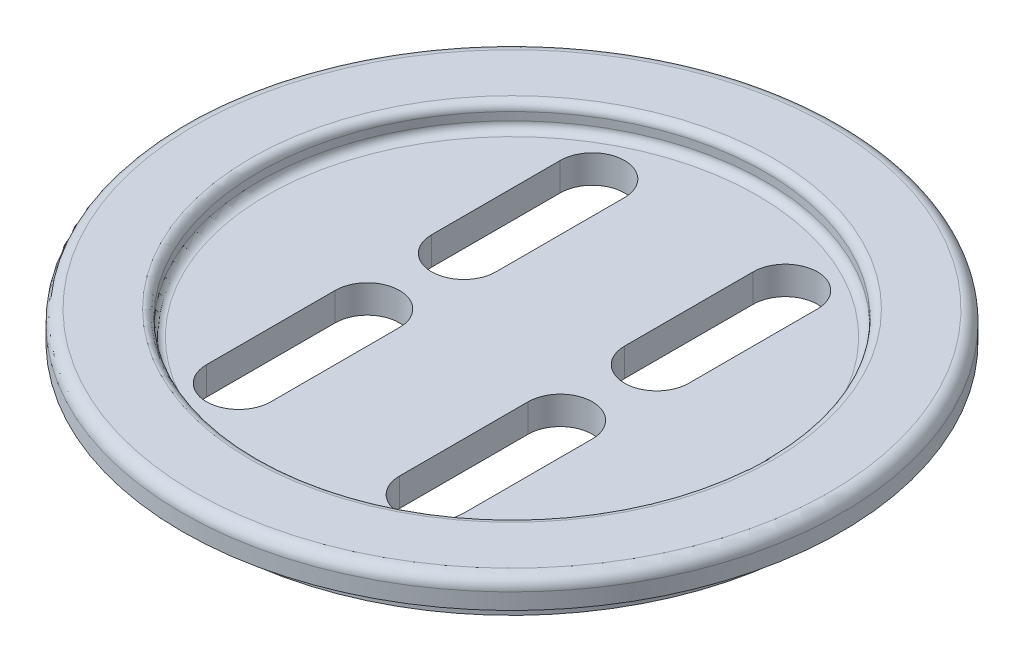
from build123d import *

# Parameters (mm, degrees)
SKETCH1_R           = 41
BOSS_EXTRUDE1_DEPTH = 3.5
SKETCH2_R           = 37.5
BOSS_EXTRUDE2_DEPTH = 3
SKETCH3_R           = 31.5
CUT_EXTRUDE1_DEPTH  = 3
ROUNDED_SLOTS_DEPTH = 59.088294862
FILLET1_R           = 1.5
FILLET2_R           = 1


with BuildPart() as part:
    # Sketch1 → Boss-Extrude1 (new body)
    with BuildSketch(Plane(origin=(0, 0, 0), x_dir=(1, 0, 0), z_dir=(0, 1, 0))):
        with Locations(Location((0, 0, 0), (0, 0, 270))):
            Circle(SKETCH1_R)
    extrude(amount=BOSS_EXTRUDE1_DEPTH)

    # Sketch2 → Boss-Extrude2 (add)
    with BuildSketch(Plane.XZ):
        with Locations(Location((0, 0, 0), (0, 0, 90))):
            Circle(SKETCH2_R)
    extrude(amount=BOSS_EXTRUDE2_DEPTH)

    # Sketch3 → Cut-Extrude1 (cut)
    with BuildSketch(Plane(origin=(0, 3.5, 0), x_dir=(-1, 0, 0), z_dir=(0, 1, 0))):
        with Locations(Location((0, 0, 0), (0, 0, 90))):
            Circle(SKETCH3_R)
    extrude(amount=-CUT_EXTRUDE1_DEPTH, mode=Mode.SUBTRACT)

    # Sketch4 → Rounded Slots (cut, through all)
    with BuildSketch(Plane(origin=(0, 0.5, 0), x_dir=(-1, 0, 0), z_dir=(0, 1, 0))):
        with BuildLine():
            Line((-8, -6), (-8, -22))
            ThreePointArc((-8, -22), (-12, -26), (-16, -22))
            Line((-16, -22), (-16, -6))
            ThreePointArc((-16, -6), (-12, -2), (-8, -6))
        make_face()
        with BuildLine():
            Line((8, -6), (8, -22))
            ThreePointArc((8, -22), (12, -26), (16, -22))
            Line((16, -22), (16, -6))
            ThreePointArc((16, -6), (12, -2), (8, -6))
        make_face()
        with BuildLine():
            Line((16, 22), (16, 6))
            ThreePointArc((16, 6), (12, 2), (8, 6))
            Line((8, 6), (8, 22))
            ThreePointArc((8, 22), (12, 26), (16, 22))
        make_face()
        with BuildLine():
            Line((-16, 22), (-16, 6))
            ThreePointArc((-16, 6), (-12, 2), (-8, 6))
            Line((-8, 6), (-8, 22))
            ThreePointArc((-8, 22), (-12, 26), (-16, 22))
        make_face()
    extrude(amount=-ROUNDED_SLOTS_DEPTH, mode=Mode.SUBTRACT)

    # Fillet1
    fillet1_edges = [part.edges().sort_by_distance(p)[0] for p in [
        (0, 3.5, -41),
    ]]
    fillet(fillet1_edges, radius=FILLET1_R)

    # Fillet2
    fillet2_edges = [part.edges().sort_by_distance(p)[0] for p in [
        (0, 0.5, -31.5),
        (0, 3.5, -31.5),
    ]]
    fillet(fillet2_edges, radius=FILLET2_R)


solid = part.part
